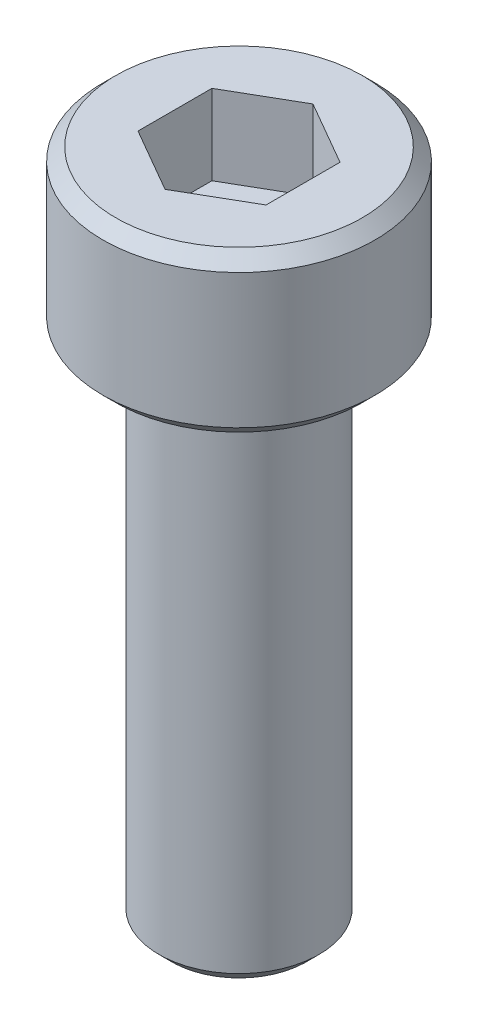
ISO-10303-21;
HEADER;
FILE_DESCRIPTION(('STEP AP214'),'2;1');
FILE_NAME('part.step','',(''),(''),'','','');
FILE_SCHEMA(('AUTOMOTIVE_DESIGN { 1 0 10303 214 1 1 1 1 }'));
ENDSEC;
DATA;
#1=APPLICATION_CONTEXT('core data for automotive mechanical design processes');
#2=APPLICATION_PROTOCOL_DEFINITION('international standard','automotive_design',2000,#1);
#3=PRODUCT_CONTEXT('',#1,'mechanical');
#4=PRODUCT('Part','Part','',(#3));
#5=PRODUCT_RELATED_PRODUCT_CATEGORY('part','',(#4));
#6=PRODUCT_DEFINITION_FORMATION('','',#4);
#7=PRODUCT_DEFINITION_CONTEXT('part definition',#1,'design');
#8=PRODUCT_DEFINITION('design','',#6,#7);
#9=PRODUCT_DEFINITION_SHAPE('','',#8);
#10=(LENGTH_UNIT() NAMED_UNIT(*) SI_UNIT(.MILLI.,.METRE.));
#11=(NAMED_UNIT(*) PLANE_ANGLE_UNIT() SI_UNIT($,.RADIAN.));
#12=(NAMED_UNIT(*) SI_UNIT($,.STERADIAN.) SOLID_ANGLE_UNIT());
#13=UNCERTAINTY_MEASURE_WITH_UNIT(LENGTH_MEASURE(1.E-05),#10,'distance_accuracy_value','');
#14=(GEOMETRIC_REPRESENTATION_CONTEXT(3) GLOBAL_UNCERTAINTY_ASSIGNED_CONTEXT((#13)) GLOBAL_UNIT_ASSIGNED_CONTEXT((#10,
#11,#12)) REPRESENTATION_CONTEXT('',''));
#15=CARTESIAN_POINT('',(0.,0.,0.));
#16=DIRECTION('',(0.,0.,1.));
#17=DIRECTION('',(1.,0.,0.));
#18=AXIS2_PLACEMENT_3D('',#15,#16,#17);
#19=CARTESIAN_POINT('',(0.,0.,0.));
#20=DIRECTION('',(0.,-1.,0.));
#21=DIRECTION('',(0.,0.,-1.));
#22=AXIS2_PLACEMENT_3D('',#19,#20,#21);
#23=PLANE('',#22);
#24=CARTESIAN_POINT('',(0.,0.,0.));
#25=DIRECTION('',(0.,-1.,0.));
#26=DIRECTION('',(0.,0.,-1.));
#27=AXIS2_PLACEMENT_3D('',#24,#25,#26);
#28=CIRCLE('',#27,2.1);
#29=CARTESIAN_POINT('',(0.,0.,-2.09999999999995));
#30=VERTEX_POINT('',#29);
#31=EDGE_CURVE('E45',#30,#30,#28,.T.);
#32=ORIENTED_EDGE('',*,*,#31,.T.);
#33=EDGE_LOOP('',(#32));
#34=FACE_BOUND('',#33,.T.);
#35=ADVANCED_FACE('F38',(#34),#23,.T.);
#36=CARTESIAN_POINT('',(0.,0.,0.));
#37=DIRECTION('',(0.,-1.,0.));
#38=DIRECTION('',(0.,0.,-1.));
#39=AXIS2_PLACEMENT_3D('',#36,#37,#38);
#40=CYLINDRICAL_SURFACE('',#39,2.5);
#41=CARTESIAN_POINT('',(0.,0.3999999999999,1.11022302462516E-13));
#42=DIRECTION('',(0.,-1.,0.));
#43=DIRECTION('',(0.,0.,-1.));
#44=AXIS2_PLACEMENT_3D('',#41,#42,#43);
#45=CIRCLE('',#44,2.5);
#46=CARTESIAN_POINT('',(0.,0.3999999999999,-2.49999999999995));
#47=VERTEX_POINT('',#46);
#48=EDGE_CURVE('E11',#47,#47,#45,.F.);
#49=CARTESIAN_POINT('',(0.,15.9999999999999,1.66533453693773E-13));
#50=DIRECTION('',(0.,-1.,0.));
#51=DIRECTION('',(0.,0.,-1.));
#52=AXIS2_PLACEMENT_3D('',#49,#50,#51);
#53=CIRCLE('',#52,2.5);
#54=CARTESIAN_POINT('',(0.,15.9999999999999,-2.49999999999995));
#55=VERTEX_POINT('',#54);
#56=EDGE_CURVE('E140',#55,#55,#53,.T.);
#57=CARTESIAN_POINT('',(0.,0.3999999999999,-2.49999999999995));
#58=CARTESIAN_POINT('',(0.,0.5624999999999,-2.49999999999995));
#59=CARTESIAN_POINT('',(0.,0.7249999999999,-2.49999999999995));
#60=CARTESIAN_POINT('',(0.,1.0499999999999,-2.49999999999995));
#61=CARTESIAN_POINT('',(0.,1.2124999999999,-2.49999999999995));
#62=CARTESIAN_POINT('',(0.,1.5374999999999,-2.49999999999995));
#63=CARTESIAN_POINT('',(0.,1.6999999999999,-2.49999999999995));
#64=CARTESIAN_POINT('',(0.,2.0249999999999,-2.49999999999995));
#65=CARTESIAN_POINT('',(0.,2.1874999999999,-2.49999999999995));
#66=CARTESIAN_POINT('',(0.,2.5124999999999,-2.49999999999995));
#67=CARTESIAN_POINT('',(0.,2.6749999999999,-2.49999999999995));
#68=CARTESIAN_POINT('',(0.,2.9999999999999,-2.49999999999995));
#69=CARTESIAN_POINT('',(0.,3.1624999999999,-2.49999999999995));
#70=CARTESIAN_POINT('',(0.,3.4874999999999,-2.49999999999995));
#71=CARTESIAN_POINT('',(0.,3.6499999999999,-2.49999999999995));
#72=CARTESIAN_POINT('',(0.,3.9749999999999,-2.49999999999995));
#73=CARTESIAN_POINT('',(0.,4.1374999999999,-2.49999999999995));
#74=CARTESIAN_POINT('',(0.,4.4624999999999,-2.49999999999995));
#75=CARTESIAN_POINT('',(0.,4.6249999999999,-2.49999999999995));
#76=CARTESIAN_POINT('',(0.,4.9499999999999,-2.49999999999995));
#77=CARTESIAN_POINT('',(0.,5.1124999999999,-2.49999999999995));
#78=CARTESIAN_POINT('',(0.,5.4374999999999,-2.49999999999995));
#79=CARTESIAN_POINT('',(0.,5.5999999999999,-2.49999999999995));
#80=CARTESIAN_POINT('',(0.,5.9249999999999,-2.49999999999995));
#81=CARTESIAN_POINT('',(0.,6.0874999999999,-2.49999999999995));
#82=CARTESIAN_POINT('',(0.,6.4124999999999,-2.49999999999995));
#83=CARTESIAN_POINT('',(0.,6.5749999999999,-2.49999999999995));
#84=CARTESIAN_POINT('',(0.,6.8999999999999,-2.49999999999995));
#85=CARTESIAN_POINT('',(0.,7.0624999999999,-2.49999999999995));
#86=CARTESIAN_POINT('',(0.,7.3874999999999,-2.49999999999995));
#87=CARTESIAN_POINT('',(0.,7.5499999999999,-2.49999999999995));
#88=CARTESIAN_POINT('',(0.,7.8749999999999,-2.49999999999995));
#89=CARTESIAN_POINT('',(0.,8.0374999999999,-2.49999999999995));
#90=CARTESIAN_POINT('',(0.,8.3624999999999,-2.49999999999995));
#91=CARTESIAN_POINT('',(0.,8.5249999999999,-2.49999999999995));
#92=CARTESIAN_POINT('',(0.,8.8499999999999,-2.49999999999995));
#93=CARTESIAN_POINT('',(0.,9.0124999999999,-2.49999999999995));
#94=CARTESIAN_POINT('',(0.,9.3374999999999,-2.49999999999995));
#95=CARTESIAN_POINT('',(0.,9.4999999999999,-2.49999999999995));
#96=CARTESIAN_POINT('',(0.,9.8249999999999,-2.49999999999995));
#97=CARTESIAN_POINT('',(0.,9.9874999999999,-2.49999999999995));
#98=CARTESIAN_POINT('',(0.,10.3124999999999,-2.49999999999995));
#99=CARTESIAN_POINT('',(0.,10.4749999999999,-2.49999999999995));
#100=CARTESIAN_POINT('',(0.,10.7999999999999,-2.49999999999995));
#101=CARTESIAN_POINT('',(0.,10.9624999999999,-2.49999999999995));
#102=CARTESIAN_POINT('',(0.,11.2874999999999,-2.49999999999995));
#103=CARTESIAN_POINT('',(0.,11.4499999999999,-2.49999999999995));
#104=CARTESIAN_POINT('',(0.,11.7749999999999,-2.49999999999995));
#105=CARTESIAN_POINT('',(0.,11.9374999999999,-2.49999999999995));
#106=CARTESIAN_POINT('',(0.,12.2624999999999,-2.49999999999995));
#107=CARTESIAN_POINT('',(0.,12.4249999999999,-2.49999999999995));
#108=CARTESIAN_POINT('',(0.,12.7499999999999,-2.49999999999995));
#109=CARTESIAN_POINT('',(0.,12.9124999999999,-2.49999999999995));
#110=CARTESIAN_POINT('',(0.,13.2374999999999,-2.49999999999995));
#111=CARTESIAN_POINT('',(0.,13.3999999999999,-2.49999999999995));
#112=CARTESIAN_POINT('',(0.,13.7249999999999,-2.49999999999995));
#113=CARTESIAN_POINT('',(0.,13.8874999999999,-2.49999999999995));
#114=CARTESIAN_POINT('',(0.,14.2124999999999,-2.49999999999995));
#115=CARTESIAN_POINT('',(0.,14.3749999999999,-2.49999999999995));
#116=CARTESIAN_POINT('',(0.,14.6999999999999,-2.49999999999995));
#117=CARTESIAN_POINT('',(0.,14.8624999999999,-2.49999999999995));
#118=CARTESIAN_POINT('',(0.,15.1874999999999,-2.49999999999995));
#119=CARTESIAN_POINT('',(0.,15.3499999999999,-2.49999999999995));
#120=CARTESIAN_POINT('',(0.,15.6749999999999,-2.49999999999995));
#121=CARTESIAN_POINT('',(0.,15.8374999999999,-2.49999999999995));
#122=CARTESIAN_POINT('',(0.,15.9999999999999,-2.49999999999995));
#123=B_SPLINE_CURVE_WITH_KNOTS('',3,(#57,#58,#59,#60,#61,#62,#63,#64,#65,#66,#67,#68,#69,#70,
#71,#72,#73,#74,#75,#76,#77,#78,#79,#80,#81,#82,#83,#84,#85,#86,#87,#88,#89,#90,#91,#92,#93,#94,
#95,#96,#97,#98,#99,#100,#101,#102,#103,#104,#105,#106,#107,#108,#109,#110,#111,#112,#113,#114,
#115,#116,#117,#118,#119,#120,#121,#122),.UNSPECIFIED.,.F.,.F.,(4,2,2,2,2,2,2,2,2,2,2,2,2,2,2,2,
2,2,2,2,2,2,2,2,2,2,2,2,2,2,2,2,4),(0.,0.4875,0.975,1.4625,1.95,2.4375,2.925,3.4125,3.9,4.3875,
4.875,5.3625,5.85,6.3375,6.825,7.3125,7.8,8.2875,8.775,9.2625,9.75,10.2375,10.725,11.2125,11.7,
12.1875,12.675,13.1625,13.65,14.1375,14.625,15.1125,15.6),.UNSPECIFIED.);
#124=EDGE_CURVE('BSEAM181',#47,#55,#123,.T.);
#125=ORIENTED_EDGE('',*,*,#48,.T.);
#126=ORIENTED_EDGE('',*,*,#56,.T.);
#127=ORIENTED_EDGE('',*,*,#124,.T.);
#128=ORIENTED_EDGE('',*,*,#124,.F.);
#129=EDGE_LOOP('',(#125,#127,#126,#128));
#130=FACE_BOUND('',#129,.T.);
#131=ADVANCED_FACE('F181',(#130),#40,.T.);
#132=CARTESIAN_POINT('',(2.50000000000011,16.,0.));
#133=DIRECTION('',(0.,-1.,0.));
#134=DIRECTION('',(0.,0.,-1.));
#135=AXIS2_PLACEMENT_3D('',#132,#133,#134);
#136=PLANE('',#135);
#137=CARTESIAN_POINT('',(0.,15.9999999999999,1.66533453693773E-13));
#138=DIRECTION('',(0.,-1.,0.));
#139=DIRECTION('',(0.,0.,-1.));
#140=AXIS2_PLACEMENT_3D('',#137,#138,#139);
#141=CIRCLE('',#140,3.85);
#142=CARTESIAN_POINT('',(0.,15.9999999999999,-3.84999999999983));
#143=VERTEX_POINT('',#142);
#144=EDGE_CURVE('E158',#143,#143,#141,.T.);
#145=ORIENTED_EDGE('',*,*,#144,.T.);
#146=EDGE_LOOP('',(#145));
#147=FACE_BOUND('',#146,.T.);
#148=ORIENTED_EDGE('',*,*,#56,.F.);
#149=EDGE_LOOP('',(#148));
#150=FACE_BOUND('',#149,.T.);
#151=ADVANCED_FACE('F185',(#147,#150),#136,.T.);
#152=CARTESIAN_POINT('',(0.,0.,0.));
#153=DIRECTION('',(0.,-1.,0.));
#154=DIRECTION('',(0.,0.,-1.));
#155=AXIS2_PLACEMENT_3D('',#152,#153,#154);
#156=CYLINDRICAL_SURFACE('',#155,4.25);
#157=CARTESIAN_POINT('',(0.,20.5999999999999,0.));
#158=DIRECTION('',(0.,1.,0.));
#159=DIRECTION('',(0.,0.,1.));
#160=AXIS2_PLACEMENT_3D('',#157,#158,#159);
#161=CIRCLE('',#160,4.25);
#162=CARTESIAN_POINT('',(0.,20.5999999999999,-4.24999999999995));
#163=VERTEX_POINT('',#162);
#164=EDGE_CURVE('E152',#163,#163,#161,.F.);
#165=CARTESIAN_POINT('',(0.,16.4,0.));
#166=DIRECTION('',(0.,-1.,0.));
#167=DIRECTION('',(0.,0.,-1.));
#168=AXIS2_PLACEMENT_3D('',#165,#166,#167);
#169=CIRCLE('',#168,4.25);
#170=CARTESIAN_POINT('',(0.,16.4,-4.24999999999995));
#171=VERTEX_POINT('',#170);
#172=EDGE_CURVE('E149',#171,#171,#169,.F.);
#173=CARTESIAN_POINT('',(0.,20.5999999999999,-4.24999999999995));
#174=CARTESIAN_POINT('',(0.,20.5562499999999,-4.24999999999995));
#175=CARTESIAN_POINT('',(0.,20.5124999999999,-4.24999999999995));
#176=CARTESIAN_POINT('',(0.,20.4249999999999,-4.24999999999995));
#177=CARTESIAN_POINT('',(0.,20.3812499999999,-4.24999999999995));
#178=CARTESIAN_POINT('',(0.,20.2937499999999,-4.24999999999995));
#179=CARTESIAN_POINT('',(0.,20.2499999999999,-4.24999999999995));
#180=CARTESIAN_POINT('',(0.,20.1624999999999,-4.24999999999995));
#181=CARTESIAN_POINT('',(0.,20.1187499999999,-4.24999999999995));
#182=CARTESIAN_POINT('',(0.,20.0312499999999,-4.24999999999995));
#183=CARTESIAN_POINT('',(0.,19.9874999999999,-4.24999999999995));
#184=CARTESIAN_POINT('',(0.,19.8999999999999,-4.24999999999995));
#185=CARTESIAN_POINT('',(0.,19.8562499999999,-4.24999999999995));
#186=CARTESIAN_POINT('',(0.,19.7687499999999,-4.24999999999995));
#187=CARTESIAN_POINT('',(0.,19.7249999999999,-4.24999999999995));
#188=CARTESIAN_POINT('',(0.,19.6374999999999,-4.24999999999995));
#189=CARTESIAN_POINT('',(0.,19.5937499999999,-4.24999999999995));
#190=CARTESIAN_POINT('',(0.,19.5062499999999,-4.24999999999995));
#191=CARTESIAN_POINT('',(0.,19.4624999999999,-4.24999999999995));
#192=CARTESIAN_POINT('',(0.,19.3749999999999,-4.24999999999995));
#193=CARTESIAN_POINT('',(0.,19.3312499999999,-4.24999999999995));
#194=CARTESIAN_POINT('',(0.,19.2437499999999,-4.24999999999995));
#195=CARTESIAN_POINT('',(0.,19.1999999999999,-4.24999999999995));
#196=CARTESIAN_POINT('',(0.,19.1124999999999,-4.24999999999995));
#197=CARTESIAN_POINT('',(0.,19.0687499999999,-4.24999999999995));
#198=CARTESIAN_POINT('',(0.,18.9812499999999,-4.24999999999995));
#199=CARTESIAN_POINT('',(0.,18.9374999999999,-4.24999999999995));
#200=CARTESIAN_POINT('',(0.,18.8499999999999,-4.24999999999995));
#201=CARTESIAN_POINT('',(0.,18.8062499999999,-4.24999999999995));
#202=CARTESIAN_POINT('',(0.,18.7187499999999,-4.24999999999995));
#203=CARTESIAN_POINT('',(0.,18.6749999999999,-4.24999999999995));
#204=CARTESIAN_POINT('',(0.,18.5874999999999,-4.24999999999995));
#205=CARTESIAN_POINT('',(0.,18.5437499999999,-4.24999999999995));
#206=CARTESIAN_POINT('',(0.,18.4562499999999,-4.24999999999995));
#207=CARTESIAN_POINT('',(0.,18.4124999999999,-4.24999999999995));
#208=CARTESIAN_POINT('',(0.,18.3249999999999,-4.24999999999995));
#209=CARTESIAN_POINT('',(0.,18.2812499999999,-4.24999999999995));
#210=CARTESIAN_POINT('',(0.,18.1937499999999,-4.24999999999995));
#211=CARTESIAN_POINT('',(0.,18.1499999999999,-4.24999999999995));
#212=CARTESIAN_POINT('',(0.,18.0624999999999,-4.24999999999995));
#213=CARTESIAN_POINT('',(0.,18.0187499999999,-4.24999999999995));
#214=CARTESIAN_POINT('',(0.,17.9312499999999,-4.24999999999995));
#215=CARTESIAN_POINT('',(0.,17.8874999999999,-4.24999999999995));
#216=CARTESIAN_POINT('',(0.,17.7999999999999,-4.24999999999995));
#217=CARTESIAN_POINT('',(0.,17.7562499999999,-4.24999999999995));
#218=CARTESIAN_POINT('',(0.,17.6687499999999,-4.24999999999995));
#219=CARTESIAN_POINT('',(0.,17.6249999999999,-4.24999999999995));
#220=CARTESIAN_POINT('',(0.,17.5374999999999,-4.24999999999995));
#221=CARTESIAN_POINT('',(0.,17.4937499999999,-4.24999999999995));
#222=CARTESIAN_POINT('',(0.,17.40625,-4.24999999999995));
#223=CARTESIAN_POINT('',(0.,17.3625,-4.24999999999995));
#224=CARTESIAN_POINT('',(0.,17.275,-4.24999999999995));
#225=CARTESIAN_POINT('',(0.,17.23125,-4.24999999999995));
#226=CARTESIAN_POINT('',(0.,17.14375,-4.24999999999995));
#227=CARTESIAN_POINT('',(0.,17.1,-4.24999999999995));
#228=CARTESIAN_POINT('',(0.,17.0125,-4.24999999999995));
#229=CARTESIAN_POINT('',(0.,16.96875,-4.24999999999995));
#230=CARTESIAN_POINT('',(0.,16.88125,-4.24999999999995));
#231=CARTESIAN_POINT('',(0.,16.8375,-4.24999999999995));
#232=CARTESIAN_POINT('',(0.,16.75,-4.24999999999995));
#233=CARTESIAN_POINT('',(0.,16.70625,-4.24999999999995));
#234=CARTESIAN_POINT('',(0.,16.61875,-4.24999999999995));
#235=CARTESIAN_POINT('',(0.,16.575,-4.24999999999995));
#236=CARTESIAN_POINT('',(0.,16.4875,-4.24999999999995));
#237=CARTESIAN_POINT('',(0.,16.44375,-4.24999999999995));
#238=CARTESIAN_POINT('',(0.,16.4,-4.24999999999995));
#239=B_SPLINE_CURVE_WITH_KNOTS('',3,(#173,#174,#175,#176,#177,#178,#179,#180,#181,#182,#183,
#184,#185,#186,#187,#188,#189,#190,#191,#192,#193,#194,#195,#196,#197,#198,#199,#200,#201,#202,
#203,#204,#205,#206,#207,#208,#209,#210,#211,#212,#213,#214,#215,#216,#217,#218,#219,#220,#221,
#222,#223,#224,#225,#226,#227,#228,#229,#230,#231,#232,#233,#234,#235,#236,#237,#238),
.UNSPECIFIED.,.F.,.F.,(4,2,2,2,2,2,2,2,2,2,2,2,2,2,2,2,2,2,2,2,2,2,2,2,2,2,2,2,2,2,2,2,4),(0.,
0.131249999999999,0.262499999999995,0.393749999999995,0.524999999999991,0.65624999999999,
0.787499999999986,0.918749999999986,1.04999999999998,1.18124999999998,1.31249999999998,
1.44374999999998,1.57499999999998,1.70624999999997,1.83749999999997,1.96874999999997,
2.09999999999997,2.23124999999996,2.36249999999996,2.49374999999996,2.62499999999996,
2.75624999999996,2.88749999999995,3.01874999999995,3.14999999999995,3.28124999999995,
3.41249999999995,3.54374999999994,3.67499999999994,3.80624999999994,3.93749999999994,
4.06874999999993,4.19999999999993),.UNSPECIFIED.);
#240=EDGE_CURVE('BSEAM190',#163,#171,#239,.T.);
#241=ORIENTED_EDGE('',*,*,#164,.T.);
#242=ORIENTED_EDGE('',*,*,#172,.T.);
#243=ORIENTED_EDGE('',*,*,#240,.T.);
#244=ORIENTED_EDGE('',*,*,#240,.F.);
#245=EDGE_LOOP('',(#241,#243,#242,#244));
#246=FACE_BOUND('',#245,.T.);
#247=ADVANCED_FACE('F190',(#246),#156,.T.);
#248=CARTESIAN_POINT('',(4.25000000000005,20.9999999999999,1.66533453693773E-13));
#249=DIRECTION('',(0.,1.,0.));
#250=DIRECTION('',(0.,0.,1.));
#251=AXIS2_PLACEMENT_3D('',#248,#249,#250);
#252=PLANE('',#251);
#253=DIRECTION('',(0.866025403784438,0.,-0.5));
#254=VECTOR('',#253,1.);
#255=CARTESIAN_POINT('',(0.,21.,2.3094010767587));
#256=LINE('',#255,#254);
#257=CARTESIAN_POINT('',(0.,21.,2.3094010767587));
#258=VERTEX_POINT('',#257);
#259=CARTESIAN_POINT('',(2.00000000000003,20.9999999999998,1.15470053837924));
#260=VERTEX_POINT('',#259);
#261=EDGE_CURVE('E52',#258,#260,#256,.T.);
#262=ORIENTED_EDGE('',*,*,#261,.F.);
#263=DIRECTION('',(0.86602540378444,0.,0.500000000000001));
#264=VECTOR('',#263,1.);
#265=CARTESIAN_POINT('',(-1.99999999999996,20.9999999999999,1.15470053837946));
#266=LINE('',#265,#264);
#267=CARTESIAN_POINT('',(-1.99999999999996,20.9999999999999,1.15470053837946));
#268=VERTEX_POINT('',#267);
#269=EDGE_CURVE('E122',#268,#258,#266,.T.);
#270=ORIENTED_EDGE('',*,*,#269,.F.);
#271=DIRECTION('',(0.,0.,1.));
#272=VECTOR('',#271,1.);
#273=CARTESIAN_POINT('',(-1.99999999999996,20.9999999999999,-1.15470053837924));
#274=LINE('',#273,#272);
#275=CARTESIAN_POINT('',(-1.99999999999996,20.9999999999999,-1.15470053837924));
#276=VERTEX_POINT('',#275);
#277=EDGE_CURVE('E116',#276,#268,#274,.T.);
#278=ORIENTED_EDGE('',*,*,#277,.F.);
#279=DIRECTION('',(-0.866025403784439,0.,0.5));
#280=VECTOR('',#279,1.);
#281=CARTESIAN_POINT('',(0.,21.,-2.30940107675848));
#282=LINE('',#281,#280);
#283=CARTESIAN_POINT('',(0.,21.,-2.30940107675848));
#284=VERTEX_POINT('',#283);
#285=EDGE_CURVE('E114',#284,#276,#282,.T.);
#286=ORIENTED_EDGE('',*,*,#285,.F.);
#287=DIRECTION('',(-0.866025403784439,0.,-0.500000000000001));
#288=VECTOR('',#287,1.);
#289=CARTESIAN_POINT('',(2.00000000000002,21.,-1.15470053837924));
#290=LINE('',#289,#288);
#291=CARTESIAN_POINT('',(2.00000000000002,21.,-1.15470053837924));
#292=VERTEX_POINT('',#291);
#293=EDGE_CURVE('E95',#292,#284,#290,.T.);
#294=ORIENTED_EDGE('',*,*,#293,.F.);
#295=DIRECTION('',(0.,0.,-1.));
#296=VECTOR('',#295,1.);
#297=CARTESIAN_POINT('',(2.00000000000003,20.9999999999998,1.15470053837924));
#298=LINE('',#297,#296);
#299=EDGE_CURVE('E106',#260,#292,#298,.T.);
#300=ORIENTED_EDGE('',*,*,#299,.F.);
#301=EDGE_LOOP('',(#262,#270,#278,#286,#294,#300));
#302=FACE_BOUND('',#301,.T.);
#303=CARTESIAN_POINT('',(0.,21.,1.11022302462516E-13));
#304=DIRECTION('',(0.,1.,0.));
#305=DIRECTION('',(0.,0.,1.));
#306=AXIS2_PLACEMENT_3D('',#303,#304,#305);
#307=CIRCLE('',#306,3.85);
#308=CARTESIAN_POINT('',(0.,21.,-3.84999999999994));
#309=VERTEX_POINT('',#308);
#310=EDGE_CURVE('E155',#309,#309,#307,.T.);
#311=ORIENTED_EDGE('',*,*,#310,.T.);
#312=EDGE_LOOP('',(#311));
#313=FACE_BOUND('',#312,.T.);
#314=ADVANCED_FACE('F110',(#302,#313),#252,.T.);
#315=CARTESIAN_POINT('',(0.,20.5999999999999,0.));
#316=DIRECTION('',(0.,-1.,0.));
#317=DIRECTION('',(0.,0.,-1.));
#318=AXIS2_PLACEMENT_3D('',#315,#316,#317);
#319=CONICAL_SURFACE('',#318,4.25,0.785398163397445);
#320=CARTESIAN_POINT('',(0.,21.,-3.84999999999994));
#321=CARTESIAN_POINT('',(0.,20.9958333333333,-3.85416666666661));
#322=CARTESIAN_POINT('',(0.,20.9916666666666,-3.85833333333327));
#323=CARTESIAN_POINT('',(0.,20.9833333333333,-3.86666666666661));
#324=CARTESIAN_POINT('',(0.,20.9791666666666,-3.87083333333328));
#325=CARTESIAN_POINT('',(0.,20.9708333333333,-3.87916666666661));
#326=CARTESIAN_POINT('',(0.,20.9666666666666,-3.88333333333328));
#327=CARTESIAN_POINT('',(0.,20.9583333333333,-3.89166666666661));
#328=CARTESIAN_POINT('',(0.,20.9541666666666,-3.89583333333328));
#329=CARTESIAN_POINT('',(0.,20.9458333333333,-3.90416666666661));
#330=CARTESIAN_POINT('',(0.,20.9416666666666,-3.90833333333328));
#331=CARTESIAN_POINT('',(0.,20.9333333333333,-3.91666666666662));
#332=CARTESIAN_POINT('',(0.,20.9291666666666,-3.92083333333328));
#333=CARTESIAN_POINT('',(0.,20.9208333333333,-3.92916666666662));
#334=CARTESIAN_POINT('',(0.,20.9166666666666,-3.93333333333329));
#335=CARTESIAN_POINT('',(0.,20.9083333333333,-3.94166666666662));
#336=CARTESIAN_POINT('',(0.,20.9041666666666,-3.94583333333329));
#337=CARTESIAN_POINT('',(0.,20.8958333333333,-3.95416666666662));
#338=CARTESIAN_POINT('',(0.,20.8916666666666,-3.95833333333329));
#339=CARTESIAN_POINT('',(0.,20.8833333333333,-3.96666666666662));
#340=CARTESIAN_POINT('',(0.,20.8791666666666,-3.97083333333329));
#341=CARTESIAN_POINT('',(0.,20.8708333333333,-3.97916666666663));
#342=CARTESIAN_POINT('',(0.,20.8666666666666,-3.98333333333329));
#343=CARTESIAN_POINT('',(0.,20.8583333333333,-3.99166666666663));
#344=CARTESIAN_POINT('',(0.,20.8541666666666,-3.9958333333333));
#345=CARTESIAN_POINT('',(0.,20.8458333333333,-4.00416666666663));
#346=CARTESIAN_POINT('',(0.,20.8416666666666,-4.0083333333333));
#347=CARTESIAN_POINT('',(0.,20.8333333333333,-4.01666666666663));
#348=CARTESIAN_POINT('',(0.,20.8291666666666,-4.0208333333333));
#349=CARTESIAN_POINT('',(0.,20.8208333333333,-4.02916666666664));
#350=CARTESIAN_POINT('',(0.,20.8166666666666,-4.0333333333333));
#351=CARTESIAN_POINT('',(0.,20.8083333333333,-4.04166666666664));
#352=CARTESIAN_POINT('',(0.,20.8041666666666,-4.0458333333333));
#353=CARTESIAN_POINT('',(0.,20.7958333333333,-4.05416666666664));
#354=CARTESIAN_POINT('',(0.,20.7916666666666,-4.05833333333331));
#355=CARTESIAN_POINT('',(0.,20.7833333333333,-4.06666666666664));
#356=CARTESIAN_POINT('',(0.,20.7791666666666,-4.07083333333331));
#357=CARTESIAN_POINT('',(0.,20.7708333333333,-4.07916666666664));
#358=CARTESIAN_POINT('',(0.,20.7666666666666,-4.08333333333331));
#359=CARTESIAN_POINT('',(0.,20.7583333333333,-4.09166666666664));
#360=CARTESIAN_POINT('',(0.,20.7541666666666,-4.09583333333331));
#361=CARTESIAN_POINT('',(0.,20.7458333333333,-4.10416666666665));
#362=CARTESIAN_POINT('',(0.,20.7416666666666,-4.10833333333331));
#363=CARTESIAN_POINT('',(0.,20.7333333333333,-4.11666666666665));
#364=CARTESIAN_POINT('',(0.,20.7291666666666,-4.12083333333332));
#365=CARTESIAN_POINT('',(0.,20.7208333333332,-4.12916666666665));
#366=CARTESIAN_POINT('',(0.,20.7166666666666,-4.13333333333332));
#367=CARTESIAN_POINT('',(0.,20.7083333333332,-4.14166666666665));
#368=CARTESIAN_POINT('',(0.,20.7041666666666,-4.14583333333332));
#369=CARTESIAN_POINT('',(0.,20.6958333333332,-4.15416666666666));
#370=CARTESIAN_POINT('',(0.,20.6916666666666,-4.15833333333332));
#371=CARTESIAN_POINT('',(0.,20.6833333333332,-4.16666666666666));
#372=CARTESIAN_POINT('',(0.,20.6791666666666,-4.17083333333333));
#373=CARTESIAN_POINT('',(0.,20.6708333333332,-4.17916666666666));
#374=CARTESIAN_POINT('',(0.,20.6666666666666,-4.18333333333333));
#375=CARTESIAN_POINT('',(0.,20.6583333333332,-4.19166666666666));
#376=CARTESIAN_POINT('',(0.,20.6541666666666,-4.19583333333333));
#377=CARTESIAN_POINT('',(0.,20.6458333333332,-4.20416666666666));
#378=CARTESIAN_POINT('',(0.,20.6416666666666,-4.20833333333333));
#379=CARTESIAN_POINT('',(0.,20.6333333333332,-4.21666666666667));
#380=CARTESIAN_POINT('',(0.,20.6291666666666,-4.22083333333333));
#381=CARTESIAN_POINT('',(0.,20.6208333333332,-4.22916666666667));
#382=CARTESIAN_POINT('',(0.,20.6166666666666,-4.23333333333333));
#383=CARTESIAN_POINT('',(0.,20.6083333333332,-4.24166666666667));
#384=CARTESIAN_POINT('',(0.,20.6041666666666,-4.24583333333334));
#385=CARTESIAN_POINT('',(0.,20.5999999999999,-4.25));
#386=B_SPLINE_CURVE_WITH_KNOTS('',3,(#320,#321,#322,#323,#324,#325,#326,#327,#328,#329,#330,
#331,#332,#333,#334,#335,#336,#337,#338,#339,#340,#341,#342,#343,#344,#345,#346,#347,#348,#349,
#350,#351,#352,#353,#354,#355,#356,#357,#358,#359,#360,#361,#362,#363,#364,#365,#366,#367,#368,
#369,#370,#371,#372,#373,#374,#375,#376,#377,#378,#379,#380,#381,#382,#383,#384,#385),
.UNSPECIFIED.,.F.,.F.,(4,2,2,2,2,2,2,2,2,2,2,2,2,2,2,2,2,2,2,2,2,2,2,2,2,2,2,2,2,2,2,2,4),(0.,
0.0176776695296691,0.035355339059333,0.0530330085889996,0.0707106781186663,0.0883883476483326,
0.106066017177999,0.123743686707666,0.141421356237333,0.159099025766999,0.176776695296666,
0.194454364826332,0.212132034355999,0.229809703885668,0.247487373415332,0.265165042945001,
0.282842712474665,0.300520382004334,0.318198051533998,0.335875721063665,0.353553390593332,
0.371231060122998,0.388908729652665,0.406586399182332,0.424264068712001,0.441941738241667,
0.459619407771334,0.477297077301,0.494974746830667,0.512652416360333,0.53033008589,
0.548007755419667,0.565685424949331),.UNSPECIFIED.);
#387=EDGE_CURVE('BSEAM176',#309,#163,#386,.T.);
#388=ORIENTED_EDGE('',*,*,#310,.F.);
#389=ORIENTED_EDGE('',*,*,#164,.F.);
#390=ORIENTED_EDGE('',*,*,#387,.T.);
#391=ORIENTED_EDGE('',*,*,#387,.F.);
#392=EDGE_LOOP('',(#388,#390,#389,#391));
#393=FACE_BOUND('',#392,.T.);
#394=ADVANCED_FACE('F176',(#393),#319,.T.);
#395=CARTESIAN_POINT('',(0.,15.9999999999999,1.66533453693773E-13));
#396=DIRECTION('',(0.,1.,0.));
#397=DIRECTION('',(0.,0.,1.));
#398=AXIS2_PLACEMENT_3D('',#395,#396,#397);
#399=CONICAL_SURFACE('',#398,3.85,0.785398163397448);
#400=ORIENTED_EDGE('',*,*,#172,.F.);
#401=EDGE_LOOP('',(#400));
#402=FACE_BOUND('',#401,.T.);
#403=ORIENTED_EDGE('',*,*,#144,.F.);
#404=EDGE_LOOP('',(#403));
#405=FACE_BOUND('',#404,.T.);
#406=ADVANCED_FACE('F167',(#402,#405),#399,.T.);
#407=CARTESIAN_POINT('',(0.,0.,0.));
#408=DIRECTION('',(0.,1.,0.));
#409=DIRECTION('',(0.,0.,1.));
#410=AXIS2_PLACEMENT_3D('',#407,#408,#409);
#411=CONICAL_SURFACE('',#410,2.1,0.785398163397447);
#412=ORIENTED_EDGE('',*,*,#48,.F.);
#413=EDGE_LOOP('',(#412));
#414=FACE_BOUND('',#413,.T.);
#415=ORIENTED_EDGE('',*,*,#31,.F.);
#416=EDGE_LOOP('',(#415));
#417=FACE_BOUND('',#416,.T.);
#418=ADVANCED_FACE('F164',(#414,#417),#411,.T.);
#419=CARTESIAN_POINT('',(1.11022302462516E-13,18.4999999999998,2.30940107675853));
#420=DIRECTION('',(0.500000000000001,0.,0.866025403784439));
#421=DIRECTION('',(0.866025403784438,0.,-0.5));
#422=AXIS2_PLACEMENT_3D('',#419,#420,#421);
#423=PLANE('',#422);
#424=ORIENTED_EDGE('',*,*,#261,.T.);
#425=DIRECTION('',(0.,1.,0.));
#426=VECTOR('',#425,1.);
#427=CARTESIAN_POINT('',(1.99999999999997,18.4999999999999,1.15470053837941));
#428=LINE('',#427,#426);
#429=CARTESIAN_POINT('',(1.99999999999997,18.4999999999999,1.15470053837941));
#430=VERTEX_POINT('',#429);
#431=EDGE_CURVE('E103',#430,#260,#428,.T.);
#432=ORIENTED_EDGE('',*,*,#431,.F.);
#433=DIRECTION('',(0.866025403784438,0.,-0.5));
#434=VECTOR('',#433,1.);
#435=CARTESIAN_POINT('',(1.11022302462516E-13,18.4999999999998,2.30940107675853));
#436=LINE('',#435,#434);
#437=CARTESIAN_POINT('',(1.11022302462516E-13,18.4999999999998,2.30940107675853));
#438=VERTEX_POINT('',#437);
#439=EDGE_CURVE('E124',#438,#430,#436,.T.);
#440=ORIENTED_EDGE('',*,*,#439,.F.);
#441=DIRECTION('',(0.,1.,0.));
#442=VECTOR('',#441,1.);
#443=CARTESIAN_POINT('',(1.11022302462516E-13,18.4999999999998,2.30940107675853));
#444=LINE('',#443,#442);
#445=EDGE_CURVE('E59',#438,#258,#444,.T.);
#446=ORIENTED_EDGE('',*,*,#445,.T.);
#447=EDGE_LOOP('',(#424,#432,#440,#446));
#448=FACE_BOUND('',#447,.T.);
#449=ADVANCED_FACE('F166',(#448),#423,.F.);
#450=CARTESIAN_POINT('',(-1.99999999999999,18.4999999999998,1.15470053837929));
#451=DIRECTION('',(-0.5,0.,0.866025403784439));
#452=DIRECTION('',(0.86602540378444,0.,0.500000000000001));
#453=AXIS2_PLACEMENT_3D('',#450,#451,#452);
#454=PLANE('',#453);
#455=ORIENTED_EDGE('',*,*,#269,.T.);
#456=ORIENTED_EDGE('',*,*,#445,.F.);
#457=DIRECTION('',(0.86602540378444,0.,0.500000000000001));
#458=VECTOR('',#457,1.);
#459=CARTESIAN_POINT('',(-1.99999999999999,18.4999999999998,1.15470053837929));
#460=LINE('',#459,#458);
#461=CARTESIAN_POINT('',(-1.99999999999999,18.4999999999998,1.15470053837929));
#462=VERTEX_POINT('',#461);
#463=EDGE_CURVE('E136',#462,#438,#460,.T.);
#464=ORIENTED_EDGE('',*,*,#463,.F.);
#465=DIRECTION('',(0.,1.,0.));
#466=VECTOR('',#465,1.);
#467=CARTESIAN_POINT('',(-1.99999999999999,18.4999999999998,1.15470053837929));
#468=LINE('',#467,#466);
#469=EDGE_CURVE('E141',#462,#268,#468,.T.);
#470=ORIENTED_EDGE('',*,*,#469,.T.);
#471=EDGE_LOOP('',(#455,#456,#464,#470));
#472=FACE_BOUND('',#471,.T.);
#473=ADVANCED_FACE('F174',(#472),#454,.F.);
#474=CARTESIAN_POINT('',(-1.99999999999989,18.4999999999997,-1.15470053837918));
#475=DIRECTION('',(-1.,0.,0.));
#476=DIRECTION('',(0.,0.,1.));
#477=AXIS2_PLACEMENT_3D('',#474,#475,#476);
#478=PLANE('',#477);
#479=ORIENTED_EDGE('',*,*,#277,.T.);
#480=ORIENTED_EDGE('',*,*,#469,.F.);
#481=DIRECTION('',(0.,0.,1.));
#482=VECTOR('',#481,1.);
#483=CARTESIAN_POINT('',(-1.99999999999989,18.4999999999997,-1.15470053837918));
#484=LINE('',#483,#482);
#485=CARTESIAN_POINT('',(-1.99999999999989,18.4999999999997,-1.15470053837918));
#486=VERTEX_POINT('',#485);
#487=EDGE_CURVE('E133',#486,#462,#484,.T.);
#488=ORIENTED_EDGE('',*,*,#487,.F.);
#489=DIRECTION('',(0.,1.,0.));
#490=VECTOR('',#489,1.);
#491=CARTESIAN_POINT('',(-1.99999999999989,18.4999999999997,-1.15470053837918));
#492=LINE('',#491,#490);
#493=EDGE_CURVE('E143',#486,#276,#492,.T.);
#494=ORIENTED_EDGE('',*,*,#493,.T.);
#495=EDGE_LOOP('',(#479,#480,#488,#494));
#496=FACE_BOUND('',#495,.T.);
#497=ADVANCED_FACE('F238',(#496),#478,.F.);
#498=CARTESIAN_POINT('',(0.,18.5,-2.30940107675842));
#499=DIRECTION('',(-0.500000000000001,0.,-0.866025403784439));
#500=DIRECTION('',(-0.866025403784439,0.,0.5));
#501=AXIS2_PLACEMENT_3D('',#498,#499,#500);
#502=PLANE('',#501);
#503=ORIENTED_EDGE('',*,*,#285,.T.);
#504=ORIENTED_EDGE('',*,*,#493,.F.);
#505=DIRECTION('',(-0.866025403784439,0.,0.5));
#506=VECTOR('',#505,1.);
#507=CARTESIAN_POINT('',(0.,18.5,-2.30940107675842));
#508=LINE('',#507,#506);
#509=CARTESIAN_POINT('',(0.,18.5,-2.30940107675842));
#510=VERTEX_POINT('',#509);
#511=EDGE_CURVE('E130',#510,#486,#508,.T.);
#512=ORIENTED_EDGE('',*,*,#511,.F.);
#513=DIRECTION('',(0.,1.,0.));
#514=VECTOR('',#513,1.);
#515=CARTESIAN_POINT('',(0.,18.5,-2.30940107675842));
#516=LINE('',#515,#514);
#517=EDGE_CURVE('E102',#510,#284,#516,.T.);
#518=ORIENTED_EDGE('',*,*,#517,.T.);
#519=EDGE_LOOP('',(#503,#504,#512,#518));
#520=FACE_BOUND('',#519,.T.);
#521=ADVANCED_FACE('F247',(#520),#502,.F.);
#522=CARTESIAN_POINT('',(2.00000000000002,18.4999999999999,-1.15470053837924));
#523=DIRECTION('',(0.5,0.,-0.866025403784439));
#524=DIRECTION('',(-0.866025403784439,0.,-0.500000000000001));
#525=AXIS2_PLACEMENT_3D('',#522,#523,#524);
#526=PLANE('',#525);
#527=ORIENTED_EDGE('',*,*,#293,.T.);
#528=ORIENTED_EDGE('',*,*,#517,.F.);
#529=DIRECTION('',(-0.866025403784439,0.,-0.500000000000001));
#530=VECTOR('',#529,1.);
#531=CARTESIAN_POINT('',(2.00000000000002,18.4999999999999,-1.15470053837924));
#532=LINE('',#531,#530);
#533=CARTESIAN_POINT('',(2.00000000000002,18.4999999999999,-1.15470053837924));
#534=VERTEX_POINT('',#533);
#535=EDGE_CURVE('E98',#534,#510,#532,.T.);
#536=ORIENTED_EDGE('',*,*,#535,.F.);
#537=DIRECTION('',(0.,1.,0.));
#538=VECTOR('',#537,1.);
#539=CARTESIAN_POINT('',(2.00000000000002,18.4999999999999,-1.15470053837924));
#540=LINE('',#539,#538);
#541=EDGE_CURVE('E91',#534,#292,#540,.T.);
#542=ORIENTED_EDGE('',*,*,#541,.T.);
#543=EDGE_LOOP('',(#527,#528,#536,#542));
#544=FACE_BOUND('',#543,.T.);
#545=ADVANCED_FACE('F93',(#544),#526,.F.);
#546=CARTESIAN_POINT('',(1.99999999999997,18.4999999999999,1.15470053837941));
#547=DIRECTION('',(1.,0.,0.));
#548=DIRECTION('',(0.,0.,-1.));
#549=AXIS2_PLACEMENT_3D('',#546,#547,#548);
#550=PLANE('',#549);
#551=ORIENTED_EDGE('',*,*,#299,.T.);
#552=ORIENTED_EDGE('',*,*,#541,.F.);
#553=DIRECTION('',(0.,0.,-1.));
#554=VECTOR('',#553,1.);
#555=CARTESIAN_POINT('',(1.99999999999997,18.4999999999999,1.15470053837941));
#556=LINE('',#555,#554);
#557=EDGE_CURVE('E127',#430,#534,#556,.T.);
#558=ORIENTED_EDGE('',*,*,#557,.F.);
#559=ORIENTED_EDGE('',*,*,#431,.T.);
#560=EDGE_LOOP('',(#551,#552,#558,#559));
#561=FACE_BOUND('',#560,.T.);
#562=ADVANCED_FACE('F107',(#561),#550,.F.);
#563=CARTESIAN_POINT('',(4.00000000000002,18.4999999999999,0.));
#564=DIRECTION('',(0.,1.,0.));
#565=DIRECTION('',(0.,0.,1.));
#566=AXIS2_PLACEMENT_3D('',#563,#564,#565);
#567=PLANE('',#566);
#568=ORIENTED_EDGE('',*,*,#439,.T.);
#569=ORIENTED_EDGE('',*,*,#557,.T.);
#570=ORIENTED_EDGE('',*,*,#535,.T.);
#571=ORIENTED_EDGE('',*,*,#511,.T.);
#572=ORIENTED_EDGE('',*,*,#487,.T.);
#573=ORIENTED_EDGE('',*,*,#463,.T.);
#574=EDGE_LOOP('',(#568,#569,#570,#571,#572,#573));
#575=FACE_BOUND('',#574,.T.);
#576=ADVANCED_FACE('F274',(#575),#567,.T.);
#577=CLOSED_SHELL('',(#35,#131,#151,#247,#314,#394,#406,#418,#449,#473,#497,#521,#545,#562,#576));
#578=MANIFOLD_SOLID_BREP('B2',#577);
#579=ADVANCED_BREP_SHAPE_REPRESENTATION('',(#18,#578),#14);
#580=SHAPE_DEFINITION_REPRESENTATION(#9,#579);
ENDSEC;
END-ISO-10303-21;
